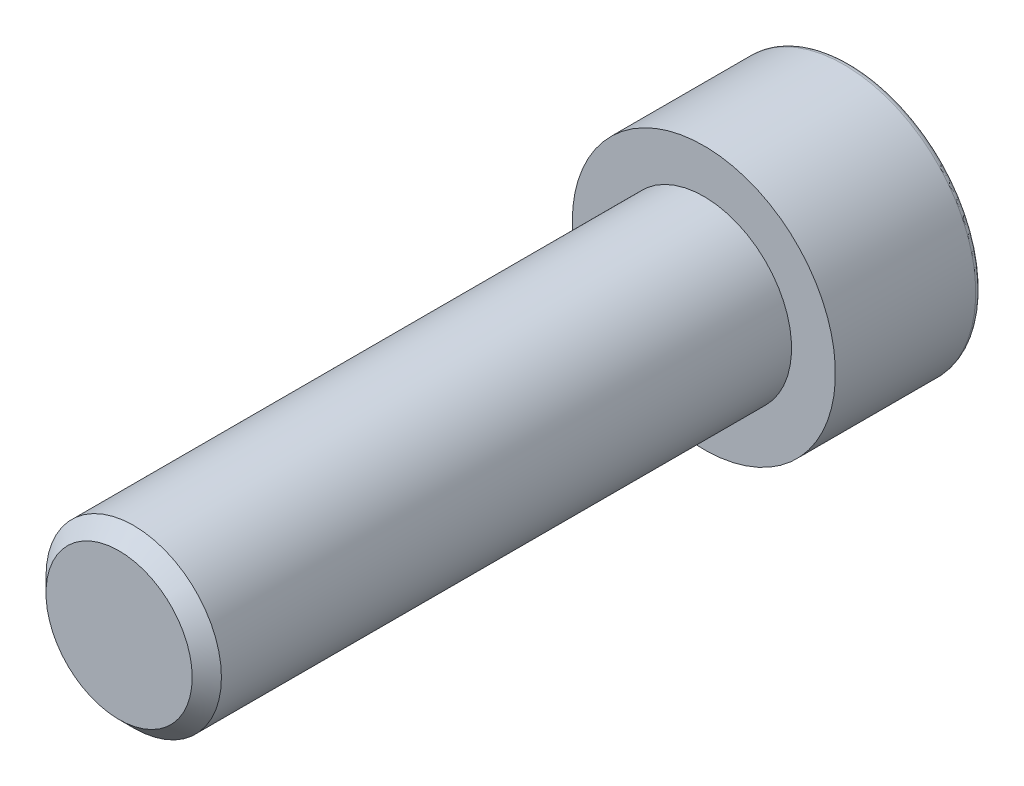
from build123d import *

# Parameters (mm, degrees)
ESQUISSE1_R             = 3
BOSS_EXTRU_1_DEPTH      = 20
CHANFREIN1_SIZE         = 0.5
ESQUISSE2_R             = 4.5
BOSS_EXTRU_2_DEPTH      = 5
ENL_V_MAT_EXTRU_1_DEPTH = 2
CONG_1_R                = 0.2


with BuildPart() as part:
    # Esquisse1 → Boss.-Extru.1 (new body)
    with BuildSketch(Plane.XY):
        Circle(ESQUISSE1_R)
    extrude(amount=BOSS_EXTRU_1_DEPTH)

    # Chanfrein1
    chanfrein1_edges = [part.edges().sort_by_distance(p)[0] for p in [
        (-3, 0, 20),
    ]]
    chamfer(chanfrein1_edges, length=CHANFREIN1_SIZE)

    # Esquisse2 → Boss.-Extru.2 (add)
    with BuildSketch(Plane(origin=(0, 0, 0), x_dir=(-1, 0, 0), z_dir=(0, 0, -1))):
        Circle(ESQUISSE2_R)
    extrude(amount=BOSS_EXTRU_2_DEPTH)

    # Esquisse3 → Enl_v. mat.-Extru.1 (cut)
    with BuildSketch(Plane(origin=(0, 0, -5), x_dir=(-1, 0, 0), z_dir=(0, 0, -1))):
        Polygon((2.717681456, 0), (1.358840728, 2.35358118), (-1.358840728, 2.35358118), (-2.717681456, 0), (-1.358840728, -2.35358118), (1.358840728, -2.35358118), align=None)
    extrude(amount=-ENL_V_MAT_EXTRU_1_DEPTH, mode=Mode.SUBTRACT)

    # Cong_1
    cong_1_edges = [part.edges().sort_by_distance(p)[0] for p in [
        (4.5, 0, -5),
    ]]
    fillet(cong_1_edges, radius=CONG_1_R)


solid = part.part
